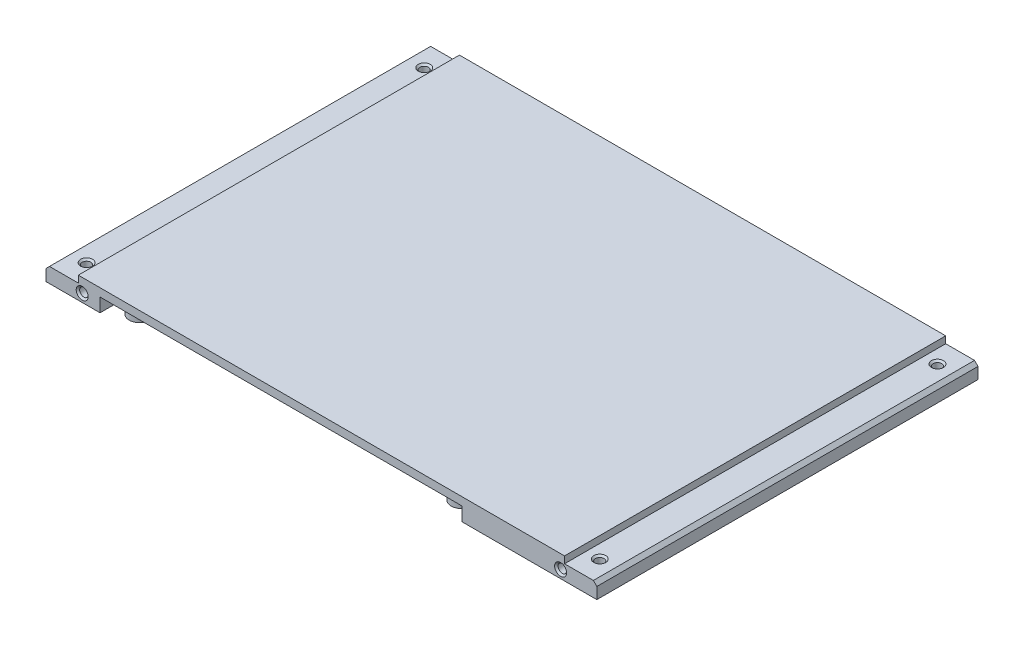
from build123d import *

# Parameters (mm, degrees)
BOSS_EXTRUDE1_DEPTH                = 111.3
SKETCH4_R                          = 3
SKETCH4_W                          = 12.7
SKETCH4_H                          = 12.7
CUT_EXTRUDE1_DEPTH                 = 4
SKETCH5_W                          = 12.7
SKETCH5_H                          = 12.7
CUT_EXTRUDE2_DEPTH                 = 2.1
SKETCH15_R                         = 3
BOSS_EXTRUDE3_DEPTH                = 3
M3X0_5_TAPPED_HOLE1_D              = 2.5
M3X0_5_TAPPED_HOLE1_CSINK_D        = 3.5
M3X0_5_TAPPED_HOLE1_CSINK_ANGLE    = 90
M3X0_5_TAPPED_HOLE2_D              = 2.5
M3X0_5_TAPPED_HOLE2_DEPTH          = 4.748924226
M3X0_5_TAPPED_HOLE2_CSINK_D        = 3.5
M3X0_5_TAPPED_HOLE2_CSINK_ANGLE    = 90
M3X0_5_TAPPED_HOLE2_TIP            = 0.751075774
M3X0_5_TAPPED_HOLE3_D              = 2.5
M3X0_5_TAPPED_HOLE3_DEPTH          = 9.248924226
M3X0_5_TAPPED_HOLE3_CSINK_D        = 3.5
M3X0_5_TAPPED_HOLE3_CSINK_ANGLE    = 90
M3X0_5_TAPPED_HOLE3_TIP            = 0.751075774
M3X0_5_TAPPED_HOLE4_D              = 2.5
M3X0_5_TAPPED_HOLE4_DEPTH          = 9.248924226
M3X0_5_TAPPED_HOLE4_CSINK_D        = 3.5
M3X0_5_TAPPED_HOLE4_CSINK_ANGLE    = 90
M3X0_5_TAPPED_HOLE4_TIP            = 0.751075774
M3X0_5_TAPPED_HOLE5_D              = 2.5
M3X0_5_TAPPED_HOLE5_DEPTH          = 3.748924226
M3X0_5_TAPPED_HOLE5_CSINK_D        = 3.5
M3X0_5_TAPPED_HOLE5_CSINK_ANGLE    = 90
M3X0_5_TAPPED_HOLE5_TIP            = 0.751075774
M2_5X0_45_TAPPED_HOLE1_D           = 2.05
M2_5X0_45_TAPPED_HOLE1_DEPTH       = 4.884117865
M2_5X0_45_TAPPED_HOLE1_CSINK_D     = 3
M2_5X0_45_TAPPED_HOLE1_CSINK_ANGLE = 90
M2_5X0_45_TAPPED_HOLE1_TIP         = 0.615882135
FILLET1_R                          = 1.5875
CHAMFER1_SIZE                      = 1.016
SKETCH20_W                         = 25.14232
SKETCH20_H                         = 14.675
CUT_EXTRUDE3_DEPTH                 = 2


with BuildPart() as part:
    # Sketch1 → Boss-Extrude1 (new body)
    with BuildSketch(Plane.XY):
        Polygon((-70.993, -2), (-80.423, -2), (-80.423, -6.35), (80.423, -6.35), (80.423, -2), (70.993, -2), (70.993, 0), (-70.993, 0), align=None)
    extrude(amount=-BOSS_EXTRUDE1_DEPTH)

    # Sketch4 → Cut-Extrude1 (cut)
    with BuildSketch(Plane.XZ.offset(6.35)):
        Polygon((-64.643, 0), (-64.643, -77.56151791), (-22.9997, -77.56151791), (-22.9997, -93.06151791), (41.00068, -93.06151791), (41.00068, -77.56151791), (64.643, -77.56151791), (64.643, -51.88651791), (39.50068, -51.88651791), (39.50068, -40.38651791), (64.643, -40.38651791), (64.643, -14.71151791), (41.00068, -14.71151791), (41.00068, 0), align=None)
        with Locations(Location((-58.5, -71.38651791, 0), (0, 0, 270))):
            Circle(SKETCH4_R, mode=Mode.SUBTRACT)
        with Locations(Location((35.5, -71.38651791, 0), (0, 0, 270))):
            Circle(SKETCH4_R, mode=Mode.SUBTRACT)
        with Locations(Location((35.5, -5.38651791, 0), (0, 0, 270))):
            Circle(SKETCH4_R, mode=Mode.SUBTRACT)
        with Locations(Location((-58.5, -5.38651791, 0), (0, 0, 270))):
            Circle(SKETCH4_R, mode=Mode.SUBTRACT)
        with Locations((-30.44, -49.58651791)):
            Rectangle(SKETCH4_W, SKETCH4_H, mode=Mode.SUBTRACT)
    extrude(amount=-CUT_EXTRUDE1_DEPTH, mode=Mode.SUBTRACT)

    # Sketch5 → Cut-Extrude2 (cut)
    with BuildSketch(Plane.XZ.offset(6.35)):
        with Locations((-30.44, -49.58651791)):
            Rectangle(SKETCH5_W, SKETCH5_H)
    extrude(amount=-CUT_EXTRUDE2_DEPTH, mode=Mode.SUBTRACT)

    # Sketch15 → Boss-Extrude3 (add)
    with BuildSketch(Plane.XZ.offset(2.35)):
        with Locations(Location((34.00000004, -85.88000208, 0), (0, 0, 90))):
            Circle(SKETCH15_R)
        with Locations(Location((-15.99999996, -85.88000208, 0), (0, 0, 90))):
            Circle(SKETCH15_R)
        with Locations(Location((34.00000004, -35.88000208, 0), (0, 0, 90))):
            Circle(SKETCH15_R)
        with Locations(Location((-15.99999996, -35.88000208, 0), (0, 0, 90))):
            Circle(SKETCH15_R)
    extrude(amount=BOSS_EXTRUDE3_DEPTH)

    # M3x0.5 Tapped Hole1 (through all)
    with Locations(Plane(origin=(0, -2, 0), x_dir=(1, 0, 0), z_dir=(0, 1, 0))):
        with Locations((-74.93, 6.35), (-74.93, 104.95), (74.93, 104.95), (74.93, 6.35)):
            CounterSinkHole(M3X0_5_TAPPED_HOLE1_D / 2, M3X0_5_TAPPED_HOLE1_CSINK_D / 2, counter_sink_angle=M3X0_5_TAPPED_HOLE1_CSINK_ANGLE)

    # M3x0.5 Tapped Hole2
    with Locations(Plane(origin=(0, -6.35, 0), x_dir=(-1, 0, 0), z_dir=(0, -1, 0))):
        with Locations((68, 97.88), (58.5, 71.38651791), (68, 20.88), (58.5, 5.38651791), (-35.5, 71.38651791), (-35.5, 5.38651791), (-68, 97.88), (-68, 20.88)):
            CounterSinkHole(M3X0_5_TAPPED_HOLE2_D / 2, M3X0_5_TAPPED_HOLE2_CSINK_D / 2, depth=M3X0_5_TAPPED_HOLE2_DEPTH, counter_sink_angle=M3X0_5_TAPPED_HOLE2_CSINK_ANGLE)
            with Locations((0, 0, -(M3X0_5_TAPPED_HOLE2_DEPTH + M3X0_5_TAPPED_HOLE2_TIP / 2))):  # 118° drill point
                Cone(0, M3X0_5_TAPPED_HOLE2_D / 2, M3X0_5_TAPPED_HOLE2_TIP, mode=Mode.SUBTRACT)

    # M3x0.5 Tapped Hole3
    with Locations(Plane.XY):
        with Locations((-69.85, -4), (69.85, -4)):
            CounterSinkHole(M3X0_5_TAPPED_HOLE3_D / 2, M3X0_5_TAPPED_HOLE3_CSINK_D / 2, depth=M3X0_5_TAPPED_HOLE3_DEPTH, counter_sink_angle=M3X0_5_TAPPED_HOLE3_CSINK_ANGLE)
            with Locations((0, 0, -(M3X0_5_TAPPED_HOLE3_DEPTH + M3X0_5_TAPPED_HOLE3_TIP / 2))):  # 118° drill point
                Cone(0, M3X0_5_TAPPED_HOLE3_D / 2, M3X0_5_TAPPED_HOLE3_TIP, mode=Mode.SUBTRACT)

    # M3x0.5 Tapped Hole4
    with Locations(Plane(origin=(0, 0, -111.3), x_dir=(-1, 0, 0), z_dir=(0, 0, -1))):
        with Locations((-69.85, -4), (69.85, -4), (0, -4)):
            CounterSinkHole(M3X0_5_TAPPED_HOLE4_D / 2, M3X0_5_TAPPED_HOLE4_CSINK_D / 2, depth=M3X0_5_TAPPED_HOLE4_DEPTH, counter_sink_angle=M3X0_5_TAPPED_HOLE4_CSINK_ANGLE)
            with Locations((0, 0, -(M3X0_5_TAPPED_HOLE4_DEPTH + M3X0_5_TAPPED_HOLE4_TIP / 2))):  # 118° drill point
                Cone(0, M3X0_5_TAPPED_HOLE4_D / 2, M3X0_5_TAPPED_HOLE4_TIP, mode=Mode.SUBTRACT)

    # M3x0.5 Tapped Hole5
    with Locations(Plane(origin=(0, -5.35, 0), x_dir=(-1, 0, 0), z_dir=(0, -1, 0))):
        with Locations((15.99999996, 35.88000208), (-34.00000004, 35.88000208), (15.99999996, 85.88000208), (-34.00000004, 85.88000208)):
            CounterSinkHole(M3X0_5_TAPPED_HOLE5_D / 2, M3X0_5_TAPPED_HOLE5_CSINK_D / 2, depth=M3X0_5_TAPPED_HOLE5_DEPTH, counter_sink_angle=M3X0_5_TAPPED_HOLE5_CSINK_ANGLE)
            with Locations((0, 0, -(M3X0_5_TAPPED_HOLE5_DEPTH + M3X0_5_TAPPED_HOLE5_TIP / 2))):  # 118° drill point
                Cone(0, M3X0_5_TAPPED_HOLE5_D / 2, M3X0_5_TAPPED_HOLE5_TIP, mode=Mode.SUBTRACT)

    # M2.5x0.45 Tapped Hole1
    with Locations(Plane(origin=(0, -6.35, 0), x_dir=(-1, 0, 0), z_dir=(0, -1, 0))):
        with Locations((26, 80.75), (26, 104.95), (66.3, 104.95), (65.55, 82)):
            CounterSinkHole(M2_5X0_45_TAPPED_HOLE1_D / 2, M2_5X0_45_TAPPED_HOLE1_CSINK_D / 2, depth=M2_5X0_45_TAPPED_HOLE1_DEPTH, counter_sink_angle=M2_5X0_45_TAPPED_HOLE1_CSINK_ANGLE)
            with Locations((0, 0, -(M2_5X0_45_TAPPED_HOLE1_DEPTH + M2_5X0_45_TAPPED_HOLE1_TIP / 2))):  # 118° drill point
                Cone(0, M2_5X0_45_TAPPED_HOLE1_D / 2, M2_5X0_45_TAPPED_HOLE1_TIP, mode=Mode.SUBTRACT)

    # Fillet1
    fillet1_edges = [part.edges().sort_by_distance(p)[0] for p in [
        (41.00068, -4.35, -14.71151791),
        (64.643, -4.35, -14.71151791),
        (64.643, -4.35, -40.38651791),
        (39.50068, -4.35, -40.38651791),
        (39.50068, -4.35, -51.88651791),
        (64.643, -4.35, -51.88651791),
        (64.643, -4.35, -77.56151791),
        (41.00068, -4.35, -77.56151791),
        (41.00068, -4.35, -93.06151791),
        (-22.9997, -4.35, -93.06151791),
        (-22.9997, -4.35, -77.56151791),
        (-64.643, -4.35, -77.56151791),
    ]]
    fillet(fillet1_edges, radius=FILLET1_R)

    # Chamfer1
    chamfer1_edges = [part.edges().sort_by_distance(p)[0] for p in [
        (-80.423, -2, -55.65),
        (80.423, -2, -55.65),
    ]]
    chamfer(chamfer1_edges, length=CHAMFER1_SIZE)

    # Sketch20 → Cut-Extrude3 (cut)
    with BuildSketch(Plane.XZ.offset(6.35)):
        with Locations((52.07184, -46.13651791)):
            Rectangle(SKETCH20_W, SKETCH20_H)
    extrude(amount=-CUT_EXTRUDE3_DEPTH, mode=Mode.SUBTRACT)


solid = part.part
